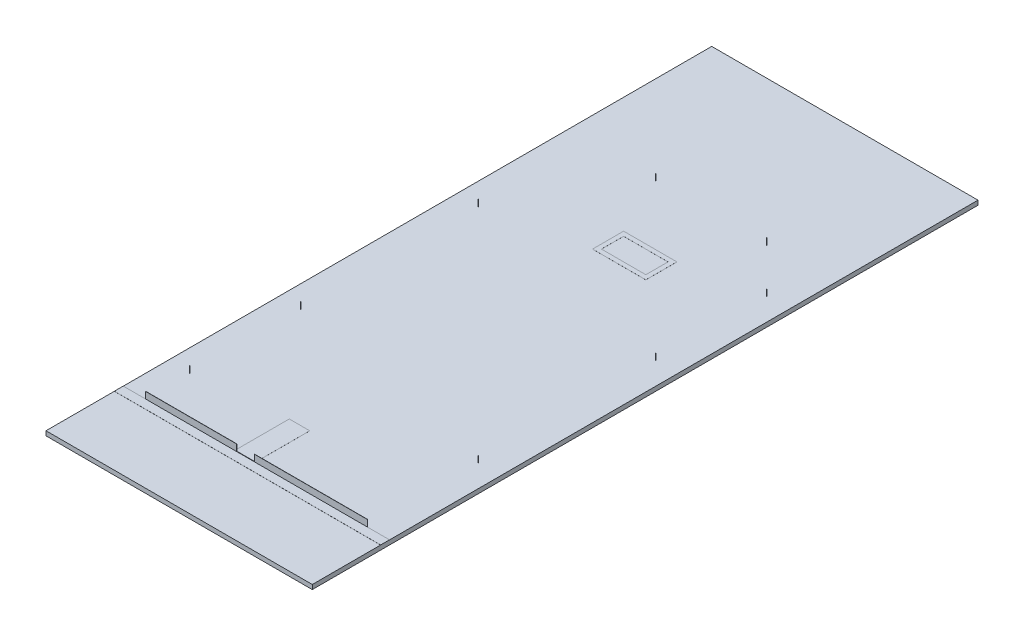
from build123d import *

# Parameters (mm, degrees)
ESQUISSE1_W                     = 60000
ESQUISSE1_H                     = 150000
BOSS_EXTRU_1_DEPTH              = 1000
ESQUISSE3_W                     = 60000
ESQUISSE3_H                     = 2000
TROTTOIR_DEPTH                  = 20
ESQUISSE4_W                     = 50000
ESQUISSE4_H                     = 40
MUR_DEPTH                       = 1500
ESQUISSE5_R                     = 5
PIQUET_DEPTH                    = 1500
R_P_TITION_LIN_AIRE1_COUNT      = 21
R_P_TITION_LIN_AIRE1_PITCH      = 5000
R_P_TITION_LIN_AIRE1_COUNT_DIR2 = 2
R_P_TITION_LIN_AIRE1_PITCH_DIR2 = 50000
ESQUISSE6_R                     = 5
PIQUET_FOND_DEPTH               = 1500
R_P_TITION_LIN_AIRE2_COUNT      = 10
R_P_TITION_LIN_AIRE2_PITCH      = 5000
ESQUISSE7_W                     = 4014.539629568
ESQUISSE7_H                     = 621.580291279
ENL_V_MAT_EXTRU_1_DEPTH         = 1400
ESQUISSE8_W                     = 12000
ESQUISSE8_H                     = 7000
BOSS_EXTRU_2_DEPTH              = 10
ESQUISSE10_W                    = 10000
ESQUISSE10_H                    = 5000
ENL_V_MAT_EXTRU_2_DEPTH         = 10
ESQUISSE11_W                    = 4614.323476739
ESQUISSE11_H                    = 12259.558606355
BOSS_EXTRU_3_DEPTH              = 10


with BuildPart() as part:
    # Esquisse1 → Boss.-Extru.1 (new body)
    with BuildSketch(Plane(origin=(0, 0, 0), x_dir=(1, 0, 0), z_dir=(0, 1, 0))):
        with Locations((0, 75000)):
            Rectangle(ESQUISSE1_W, ESQUISSE1_H)
    extrude(amount=BOSS_EXTRU_1_DEPTH)

    # Esquisse3 → trottoir (add)
    with BuildSketch(Plane(origin=(0, 1000, 0), x_dir=(1, 0, 0), z_dir=(0, 1, 0))):
        with Locations((0, 16394.454500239)):
            Rectangle(ESQUISSE3_W, ESQUISSE3_H)
    extrude(amount=TROTTOIR_DEPTH)

    # Esquisse4 → mur (add)
    with BuildSketch(Plane(origin=(0, 1000, 0), x_dir=(1, 0, 0), z_dir=(0, 1, 0))):
        with Locations((0, 17414.454500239)):
            Rectangle(ESQUISSE4_W, ESQUISSE4_H)
    extrude(amount=MUR_DEPTH)

    # Esquisse5 → piquet (add)
    with BuildSketch(Plane(origin=(0, 1000, 0), x_dir=(1, 0, 0), z_dir=(0, 1, 0))):
        with Locations((25000, 17394.454500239)):
            Circle(ESQUISSE5_R)
    piquet = extrude(amount=PIQUET_DEPTH)

    # R_p_tition lin_aire1: piquet 21 × 2
    with Locations(*[(-j * R_P_TITION_LIN_AIRE1_PITCH_DIR2, 0, -i * R_P_TITION_LIN_AIRE1_PITCH) for i in range(R_P_TITION_LIN_AIRE1_COUNT) for j in range(R_P_TITION_LIN_AIRE1_COUNT_DIR2) if (i, j) != (0, 0)]):
        add(piquet)

    # Esquisse6 → piquet fond (add)
    with BuildSketch(Plane(origin=(0, 1000, 0), x_dir=(1, 0, 0), z_dir=(0, 1, 0))):
        with Locations(Location((-25000, 117394.454500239, 0), (0, 0, 90))):
            Circle(ESQUISSE6_R)
    piquet_fond = extrude(amount=PIQUET_FOND_DEPTH)

    # R_p_tition lin_aire2: piquet fond ×10
    with Locations(*[(i * R_P_TITION_LIN_AIRE2_PITCH, 0, 0) for i in range(1, R_P_TITION_LIN_AIRE2_COUNT)]):
        add(piquet_fond)

    # Esquisse7 → Enl_v. mat.-Extru.1 (cut)
    with BuildSketch(Plane(origin=(0, 2500, 0), x_dir=(1, 0, 0), z_dir=(0, 1, 0))):
        with Locations((-2440.50757163, 17502.358088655)):
            Rectangle(ESQUISSE7_W, ESQUISSE7_H)
    extrude(amount=-ENL_V_MAT_EXTRU_1_DEPTH, mode=Mode.SUBTRACT)

    # Esquisse8 → Boss.-Extru.2 (add)
    with BuildSketch(Plane(origin=(0, 1000, 0), x_dir=(1, 0, 0), z_dir=(0, 1, 0))):
        with Locations((2137.178658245, 100514.42569595)):
            Rectangle(ESQUISSE8_W, ESQUISSE8_H)
    extrude(amount=BOSS_EXTRU_2_DEPTH)

    # Esquisse10 → Enl_v. mat.-Extru.2 (cut)
    with BuildSketch(Plane(origin=(0, 1010, 0), x_dir=(1, 0, 0), z_dir=(0, 1, 0))):
        with Locations((2137.178658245, 100514.42569595)):
            Rectangle(ESQUISSE10_W, ESQUISSE10_H)
    extrude(amount=-ENL_V_MAT_EXTRU_2_DEPTH, mode=Mode.SUBTRACT)

    # Esquisse11 → Boss.-Extru.3 (add)
    with BuildSketch(Plane(origin=(0, 1000, 0), x_dir=(1, 0, 0), z_dir=(0, 1, 0))):
        with Locations((-2574.419478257, 23564.233803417)):
            Rectangle(ESQUISSE11_W, ESQUISSE11_H)
    extrude(amount=BOSS_EXTRU_3_DEPTH)


solid = part.part
